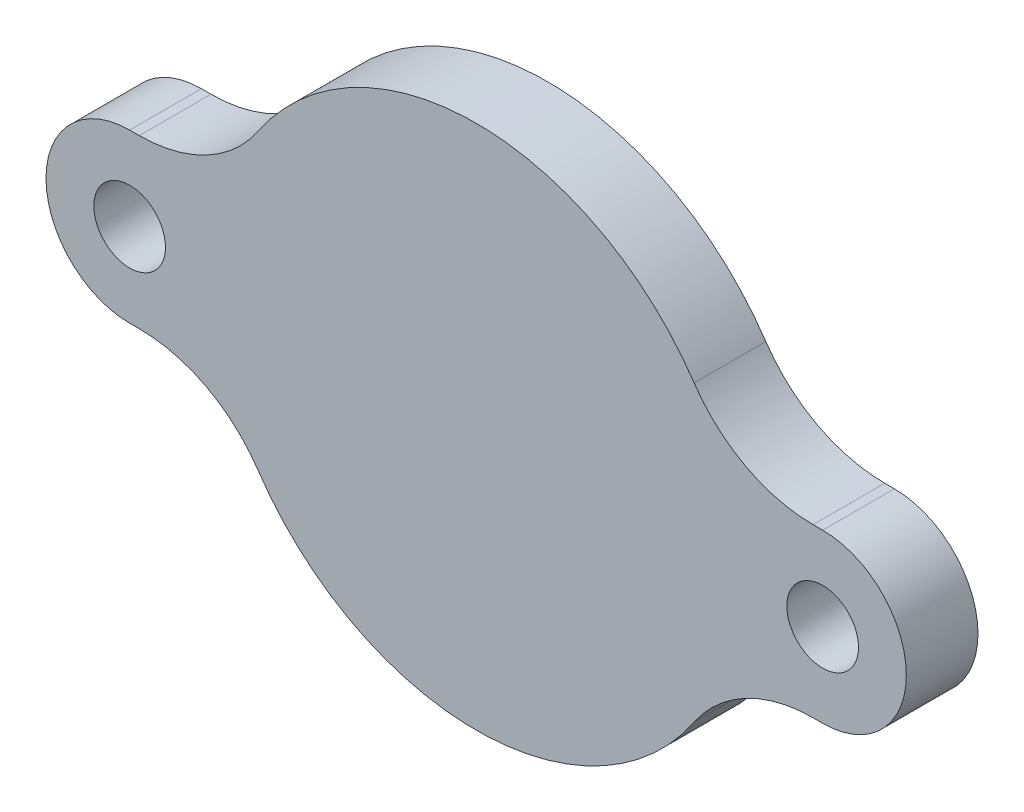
from build123d import *

# Parameters (mm, degrees)
SKETCH1_R           = 1.5
BOSS_EXTRUDE1_DEPTH = 3


with BuildPart() as part:
    # Sketch1 → Boss-Extrude1 (new body)
    with BuildSketch(Plane.XY):
        with BuildLine():
            Line((14.5, 3.5), (14.09787218, 3.5))
            ThreePointArc((14.09787218, 3.5), (11.27986287, 4.202941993), (9.122152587, 6.147058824))
            ThreePointArc((9.122152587, 6.147058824), (0, 11), (-9.122152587, 6.147058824))
            ThreePointArc((-9.122152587, 6.147058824), (-11.27986287, 4.202941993), (-14.09787218, 3.5))
            Line((-14.09787218, 3.5), (-14.5, 3.5))
            ThreePointArc((-14.5, 3.5), (-18, 0), (-14.5, -3.5))
            Line((-14.5, -3.5), (-14.09787218, -3.5))
            ThreePointArc((-14.09787218, -3.5), (-11.27986287, -4.202941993), (-9.122152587, -6.147058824))
            ThreePointArc((-9.122152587, -6.147058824), (0, -11), (9.122152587, -6.147058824))
            ThreePointArc((9.122152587, -6.147058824), (11.27986287, -4.202941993), (14.09787218, -3.5))
            Line((14.09787218, -3.5), (14.5, -3.5))
            ThreePointArc((14.5, -3.5), (18, 0), (14.5, 3.5))
        make_face()
        with Locations((14.5, 0)):
            Circle(SKETCH1_R, mode=Mode.SUBTRACT)
        with Locations((-14.5, 0)):
            Circle(SKETCH1_R, mode=Mode.SUBTRACT)
    extrude(amount=BOSS_EXTRUDE1_DEPTH)


solid = part.part
